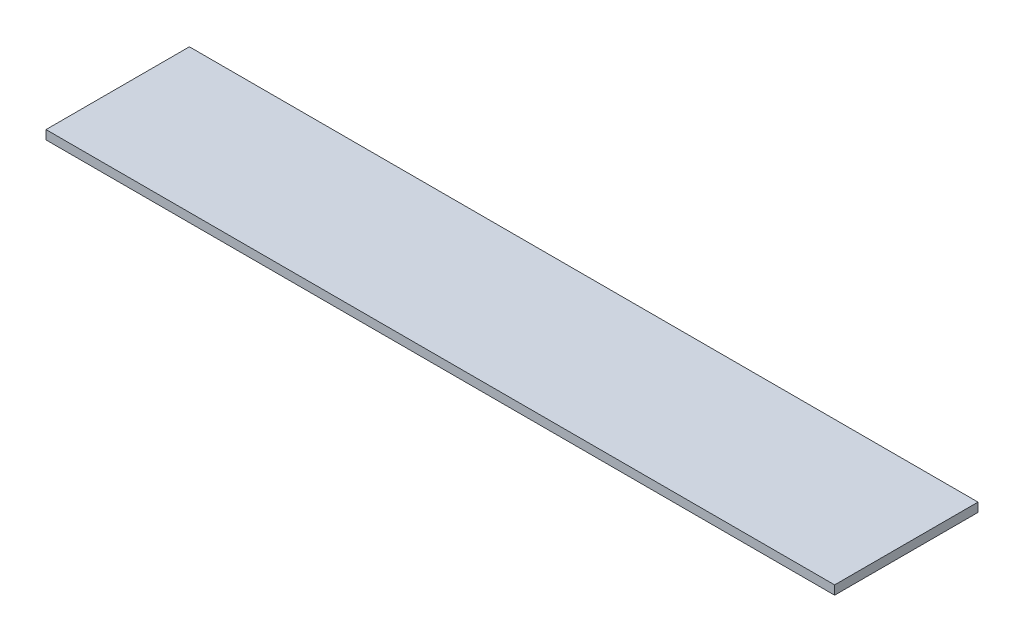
ISO-10303-21;
HEADER;
FILE_DESCRIPTION(('STEP AP214'),'2;1');
FILE_NAME('part.step','',(''),(''),'','','');
FILE_SCHEMA(('AUTOMOTIVE_DESIGN { 1 0 10303 214 1 1 1 1 }'));
ENDSEC;
DATA;
#1=APPLICATION_CONTEXT('core data for automotive mechanical design processes');
#2=APPLICATION_PROTOCOL_DEFINITION('international standard','automotive_design',2000,#1);
#3=PRODUCT_CONTEXT('',#1,'mechanical');
#4=PRODUCT('Part','Part','',(#3));
#5=PRODUCT_RELATED_PRODUCT_CATEGORY('part','',(#4));
#6=PRODUCT_DEFINITION_FORMATION('','',#4);
#7=PRODUCT_DEFINITION_CONTEXT('part definition',#1,'design');
#8=PRODUCT_DEFINITION('design','',#6,#7);
#9=PRODUCT_DEFINITION_SHAPE('','',#8);
#10=(LENGTH_UNIT() NAMED_UNIT(*) SI_UNIT(.MILLI.,.METRE.));
#11=(NAMED_UNIT(*) PLANE_ANGLE_UNIT() SI_UNIT($,.RADIAN.));
#12=(NAMED_UNIT(*) SI_UNIT($,.STERADIAN.) SOLID_ANGLE_UNIT());
#13=UNCERTAINTY_MEASURE_WITH_UNIT(LENGTH_MEASURE(1.E-05),#10,'distance_accuracy_value','');
#14=(GEOMETRIC_REPRESENTATION_CONTEXT(3) GLOBAL_UNCERTAINTY_ASSIGNED_CONTEXT((#13)) GLOBAL_UNIT_ASSIGNED_CONTEXT((#10,
#11,#12)) REPRESENTATION_CONTEXT('',''));
#15=CARTESIAN_POINT('',(0.,0.,0.));
#16=DIRECTION('',(0.,0.,1.));
#17=DIRECTION('',(1.,0.,0.));
#18=AXIS2_PLACEMENT_3D('',#15,#16,#17);
#19=CARTESIAN_POINT('',(279.4,6.35,-50.8));
#20=DIRECTION('',(-1.,0.,0.));
#21=DIRECTION('',(0.,0.,1.));
#22=AXIS2_PLACEMENT_3D('',#19,#20,#21);
#23=PLANE('',#22);
#24=DIRECTION('',(0.,0.,-1.));
#25=VECTOR('',#24,1.);
#26=CARTESIAN_POINT('',(279.4,0.,-50.8));
#27=LINE('',#26,#25);
#28=CARTESIAN_POINT('',(279.4,0.,50.8));
#29=VERTEX_POINT('',#28);
#30=CARTESIAN_POINT('',(279.4,0.,-50.8));
#31=VERTEX_POINT('',#30);
#32=EDGE_CURVE('E97',#29,#31,#27,.T.);
#33=ORIENTED_EDGE('',*,*,#32,.T.);
#34=DIRECTION('',(0.,-1.,0.));
#35=VECTOR('',#34,1.);
#36=CARTESIAN_POINT('',(279.4,6.35,-50.8));
#37=LINE('',#36,#35);
#38=CARTESIAN_POINT('',(279.4,6.35,-50.8));
#39=VERTEX_POINT('',#38);
#40=EDGE_CURVE('E11',#39,#31,#37,.T.);
#41=ORIENTED_EDGE('',*,*,#40,.F.);
#42=DIRECTION('',(0.,0.,-1.));
#43=VECTOR('',#42,1.);
#44=CARTESIAN_POINT('',(279.4,6.35,-50.8));
#45=LINE('',#44,#43);
#46=CARTESIAN_POINT('',(279.4,6.35,50.8));
#47=VERTEX_POINT('',#46);
#48=EDGE_CURVE('E85',#47,#39,#45,.T.);
#49=ORIENTED_EDGE('',*,*,#48,.F.);
#50=DIRECTION('',(0.,-1.,0.));
#51=VECTOR('',#50,1.);
#52=CARTESIAN_POINT('',(279.4,6.35,50.8));
#53=LINE('',#52,#51);
#54=EDGE_CURVE('E93',#47,#29,#53,.T.);
#55=ORIENTED_EDGE('',*,*,#54,.T.);
#56=EDGE_LOOP('',(#33,#41,#49,#55));
#57=FACE_BOUND('',#56,.T.);
#58=ADVANCED_FACE('F34',(#57),#23,.F.);
#59=CARTESIAN_POINT('',(-279.4,6.35,-50.8));
#60=DIRECTION('',(0.,0.,1.));
#61=DIRECTION('',(1.,0.,0.));
#62=AXIS2_PLACEMENT_3D('',#59,#60,#61);
#63=PLANE('',#62);
#64=DIRECTION('',(-1.,0.,0.));
#65=VECTOR('',#64,1.);
#66=CARTESIAN_POINT('',(-279.4,0.,-50.8));
#67=LINE('',#66,#65);
#68=CARTESIAN_POINT('',(-279.4,0.,-50.8));
#69=VERTEX_POINT('',#68);
#70=EDGE_CURVE('E89',#31,#69,#67,.T.);
#71=ORIENTED_EDGE('',*,*,#70,.T.);
#72=DIRECTION('',(0.,-1.,0.));
#73=VECTOR('',#72,1.);
#74=CARTESIAN_POINT('',(-279.4,6.35,-50.8));
#75=LINE('',#74,#73);
#76=CARTESIAN_POINT('',(-279.4,6.35,-50.8));
#77=VERTEX_POINT('',#76);
#78=EDGE_CURVE('E42',#77,#69,#75,.T.);
#79=ORIENTED_EDGE('',*,*,#78,.F.);
#80=DIRECTION('',(-1.,0.,0.));
#81=VECTOR('',#80,1.);
#82=CARTESIAN_POINT('',(-279.4,6.35,-50.8));
#83=LINE('',#82,#81);
#84=EDGE_CURVE('E80',#39,#77,#83,.T.);
#85=ORIENTED_EDGE('',*,*,#84,.F.);
#86=ORIENTED_EDGE('',*,*,#40,.T.);
#87=EDGE_LOOP('',(#71,#79,#85,#86));
#88=FACE_BOUND('',#87,.T.);
#89=ADVANCED_FACE('F88',(#88),#63,.F.);
#90=CARTESIAN_POINT('',(-279.4,6.35,-50.8));
#91=DIRECTION('',(1.,0.,0.));
#92=DIRECTION('',(0.,0.,-1.));
#93=AXIS2_PLACEMENT_3D('',#90,#91,#92);
#94=PLANE('',#93);
#95=DIRECTION('',(0.,0.,1.));
#96=VECTOR('',#95,1.);
#97=CARTESIAN_POINT('',(-279.4,0.,-50.8));
#98=LINE('',#97,#96);
#99=CARTESIAN_POINT('',(-279.4,0.,50.8));
#100=VERTEX_POINT('',#99);
#101=EDGE_CURVE('E67',#69,#100,#98,.T.);
#102=ORIENTED_EDGE('',*,*,#101,.T.);
#103=DIRECTION('',(0.,-1.,0.));
#104=VECTOR('',#103,1.);
#105=CARTESIAN_POINT('',(-279.4,6.35,50.8));
#106=LINE('',#105,#104);
#107=CARTESIAN_POINT('',(-279.4,6.35,50.8));
#108=VERTEX_POINT('',#107);
#109=EDGE_CURVE('E90',#108,#100,#106,.T.);
#110=ORIENTED_EDGE('',*,*,#109,.F.);
#111=DIRECTION('',(0.,0.,1.));
#112=VECTOR('',#111,1.);
#113=CARTESIAN_POINT('',(-279.4,6.35,-50.8));
#114=LINE('',#113,#112);
#115=EDGE_CURVE('E83',#77,#108,#114,.T.);
#116=ORIENTED_EDGE('',*,*,#115,.F.);
#117=ORIENTED_EDGE('',*,*,#78,.T.);
#118=EDGE_LOOP('',(#102,#110,#116,#117));
#119=FACE_BOUND('',#118,.T.);
#120=ADVANCED_FACE('F91',(#119),#94,.F.);
#121=CARTESIAN_POINT('',(-279.4,6.35,50.8));
#122=DIRECTION('',(0.,0.,-1.));
#123=DIRECTION('',(-1.,0.,0.));
#124=AXIS2_PLACEMENT_3D('',#121,#122,#123);
#125=PLANE('',#124);
#126=DIRECTION('',(1.,0.,0.));
#127=VECTOR('',#126,1.);
#128=CARTESIAN_POINT('',(-279.4,0.,50.8));
#129=LINE('',#128,#127);
#130=EDGE_CURVE('E73',#100,#29,#129,.T.);
#131=ORIENTED_EDGE('',*,*,#130,.T.);
#132=ORIENTED_EDGE('',*,*,#54,.F.);
#133=DIRECTION('',(1.,0.,0.));
#134=VECTOR('',#133,1.);
#135=CARTESIAN_POINT('',(-279.4,6.35,50.8));
#136=LINE('',#135,#134);
#137=EDGE_CURVE('E50',#108,#47,#136,.T.);
#138=ORIENTED_EDGE('',*,*,#137,.F.);
#139=ORIENTED_EDGE('',*,*,#109,.T.);
#140=EDGE_LOOP('',(#131,#132,#138,#139));
#141=FACE_BOUND('',#140,.T.);
#142=ADVANCED_FACE('F104',(#141),#125,.F.);
#143=CARTESIAN_POINT('',(279.4,6.35,50.8));
#144=DIRECTION('',(0.,1.,0.));
#145=DIRECTION('',(0.,0.,1.));
#146=AXIS2_PLACEMENT_3D('',#143,#144,#145);
#147=PLANE('',#146);
#148=ORIENTED_EDGE('',*,*,#48,.T.);
#149=ORIENTED_EDGE('',*,*,#84,.T.);
#150=ORIENTED_EDGE('',*,*,#115,.T.);
#151=ORIENTED_EDGE('',*,*,#137,.T.);
#152=EDGE_LOOP('',(#148,#149,#150,#151));
#153=FACE_BOUND('',#152,.T.);
#154=ADVANCED_FACE('F81',(#153),#147,.T.);
#155=CARTESIAN_POINT('',(279.4,0.,50.8));
#156=DIRECTION('',(0.,1.,0.));
#157=DIRECTION('',(0.,0.,1.));
#158=AXIS2_PLACEMENT_3D('',#155,#156,#157);
#159=PLANE('',#158);
#160=ORIENTED_EDGE('',*,*,#32,.F.);
#161=ORIENTED_EDGE('',*,*,#130,.F.);
#162=ORIENTED_EDGE('',*,*,#101,.F.);
#163=ORIENTED_EDGE('',*,*,#70,.F.);
#164=EDGE_LOOP('',(#160,#161,#162,#163));
#165=FACE_BOUND('',#164,.T.);
#166=ADVANCED_FACE('F107',(#165),#159,.F.);
#167=CLOSED_SHELL('',(#58,#89,#120,#142,#154,#166));
#168=MANIFOLD_SOLID_BREP('B2',#167);
#169=ADVANCED_BREP_SHAPE_REPRESENTATION('',(#18,#168),#14);
#170=SHAPE_DEFINITION_REPRESENTATION(#9,#169);
ENDSEC;
END-ISO-10303-21;
